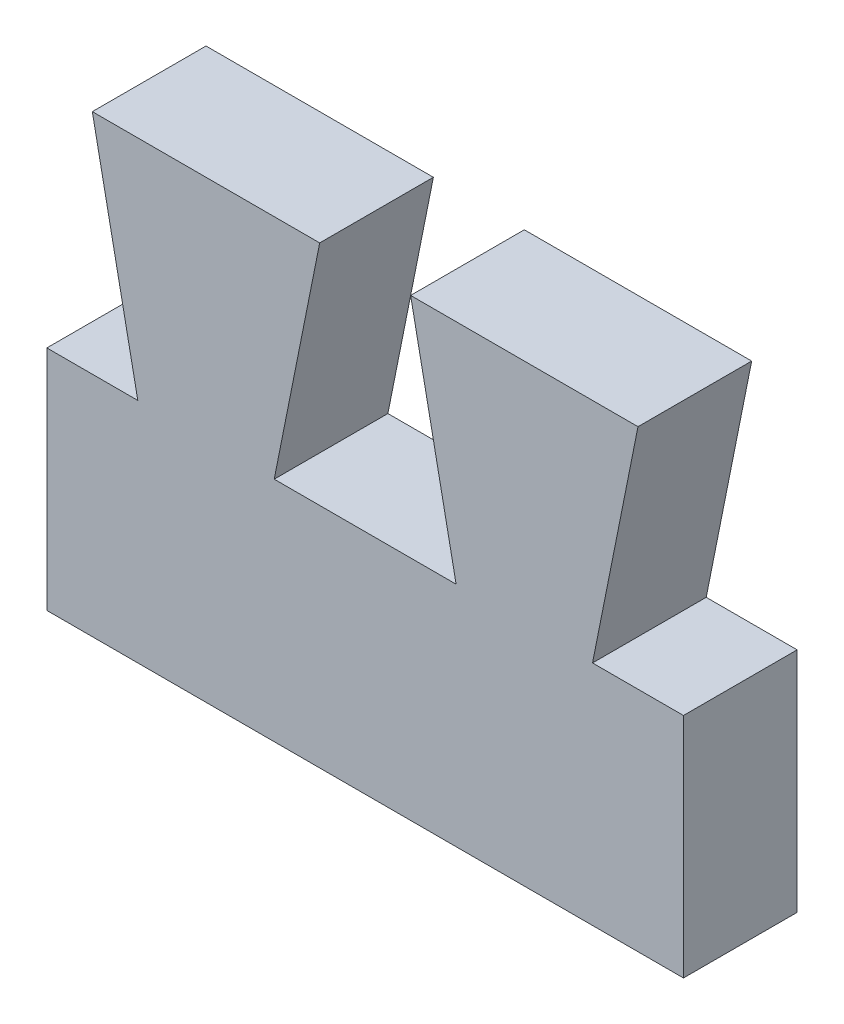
from build123d import *

# Parameters (mm, degrees)
EXTRUDE_1_DEPTH   = 5
EXTRUDE_1_2_DEPTH = 5
SKETCH_2_W        = 28
SKETCH_2_H        = 10
EXTRUDE_2_DEPTH   = 5


with BuildPart() as part:
    # Sketch 1 → Extrude 1 (new body)
    with BuildSketch(Plane.XY):
        Polygon((-2, 5), (-12, 5), (-10, -5), (-4, -5), align=None)
    extrude(amount=EXTRUDE_1_DEPTH)



with BuildPart() as body_2:
    # Sketch 1 → Extrude 1 2 (new body)
    with BuildSketch(Plane.XY):
        Polygon((12, 5), (2, 5), (4, -5), (10, -5), align=None)
    extrude(amount=EXTRUDE_1_2_DEPTH)


with BuildPart() as part_1:
    add(part.part)

    add(body_2.part)  # Extrude 2 merges body 2
    # Sketch 2 → Extrude 2 (add)
    with BuildSketch(Plane.XY.offset(5)):
        with Locations((0, -10)):
            Rectangle(SKETCH_2_W, SKETCH_2_H)
    extrude(amount=-EXTRUDE_2_DEPTH)


solid = part_1.part
